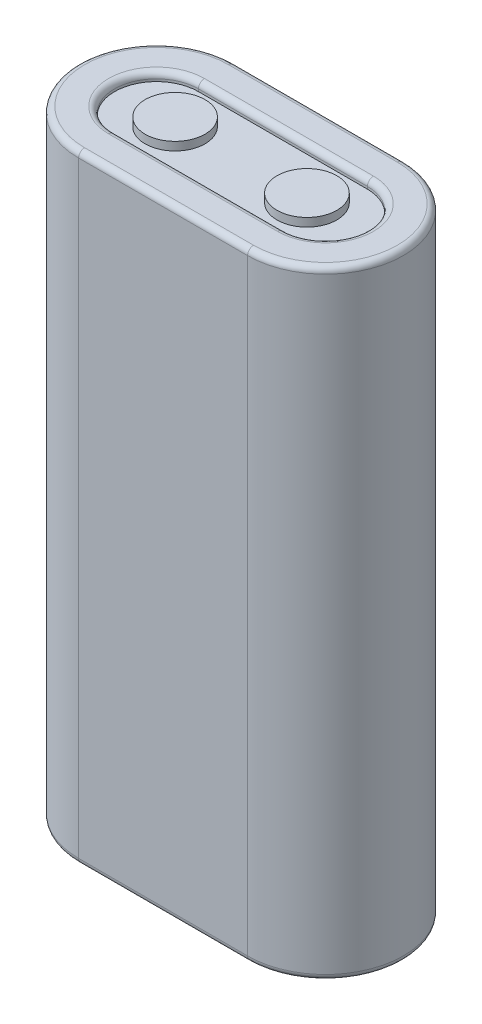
ISO-10303-21;
HEADER;
FILE_DESCRIPTION(('STEP AP214'),'2;1');
FILE_NAME('part.step','',(''),(''),'','','');
FILE_SCHEMA(('AUTOMOTIVE_DESIGN { 1 0 10303 214 1 1 1 1 }'));
ENDSEC;
DATA;
#1=APPLICATION_CONTEXT('core data for automotive mechanical design processes');
#2=APPLICATION_PROTOCOL_DEFINITION('international standard','automotive_design',2000,#1);
#3=PRODUCT_CONTEXT('',#1,'mechanical');
#4=PRODUCT('Part','Part','',(#3));
#5=PRODUCT_RELATED_PRODUCT_CATEGORY('part','',(#4));
#6=PRODUCT_DEFINITION_FORMATION('','',#4);
#7=PRODUCT_DEFINITION_CONTEXT('part definition',#1,'design');
#8=PRODUCT_DEFINITION('design','',#6,#7);
#9=PRODUCT_DEFINITION_SHAPE('','',#8);
#10=(LENGTH_UNIT() NAMED_UNIT(*) SI_UNIT(.MILLI.,.METRE.));
#11=(NAMED_UNIT(*) PLANE_ANGLE_UNIT() SI_UNIT($,.RADIAN.));
#12=(NAMED_UNIT(*) SI_UNIT($,.STERADIAN.) SOLID_ANGLE_UNIT());
#13=UNCERTAINTY_MEASURE_WITH_UNIT(LENGTH_MEASURE(1.E-05),#10,'distance_accuracy_value','');
#14=(GEOMETRIC_REPRESENTATION_CONTEXT(3) GLOBAL_UNCERTAINTY_ASSIGNED_CONTEXT((#13)) GLOBAL_UNIT_ASSIGNED_CONTEXT((#10,
#11,#12)) REPRESENTATION_CONTEXT('',''));
#15=CARTESIAN_POINT('',(0.,0.,0.));
#16=DIRECTION('',(0.,0.,1.));
#17=DIRECTION('',(1.,0.,0.));
#18=AXIS2_PLACEMENT_3D('',#15,#16,#17);
#19=CARTESIAN_POINT('',(7.05,51.6,0.));
#20=DIRECTION('',(0.,1.,0.));
#21=DIRECTION('',(0.,0.,1.));
#22=AXIS2_PLACEMENT_3D('',#19,#20,#21);
#23=PLANE('',#22);
#24=DIRECTION('',(1.,0.,0.));
#25=VECTOR('',#24,1.);
#26=CARTESIAN_POINT('',(7.05000000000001,51.6,6.));
#27=LINE('',#26,#25);
#28=CARTESIAN_POINT('',(-7.05000000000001,51.6,6.));
#29=VERTEX_POINT('',#28);
#30=CARTESIAN_POINT('',(7.05000000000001,51.6,6.));
#31=VERTEX_POINT('',#30);
#32=EDGE_CURVE('E230',#29,#31,#27,.T.);
#33=ORIENTED_EDGE('',*,*,#32,.T.);
#34=CARTESIAN_POINT('',(7.05,51.6,0.));
#35=DIRECTION('',(0.,1.,0.));
#36=DIRECTION('',(0.,0.,1.));
#37=AXIS2_PLACEMENT_3D('',#34,#35,#36);
#38=CIRCLE('',#37,6.);
#39=CARTESIAN_POINT('',(7.05000000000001,51.6,-6.));
#40=VERTEX_POINT('',#39);
#41=EDGE_CURVE('E232',#31,#40,#38,.T.);
#42=ORIENTED_EDGE('',*,*,#41,.T.);
#43=DIRECTION('',(-1.,0.,0.));
#44=VECTOR('',#43,1.);
#45=CARTESIAN_POINT('',(-7.05000000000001,51.6,-6.));
#46=LINE('',#45,#44);
#47=CARTESIAN_POINT('',(-7.05000000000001,51.6,-6.));
#48=VERTEX_POINT('',#47);
#49=EDGE_CURVE('E226',#40,#48,#46,.T.);
#50=ORIENTED_EDGE('',*,*,#49,.T.);
#51=CARTESIAN_POINT('',(-7.05,51.6,0.));
#52=DIRECTION('',(0.,1.,0.));
#53=DIRECTION('',(0.,0.,1.));
#54=AXIS2_PLACEMENT_3D('',#51,#52,#53);
#55=CIRCLE('',#54,6.);
#56=EDGE_CURVE('E228',#48,#29,#55,.T.);
#57=ORIENTED_EDGE('',*,*,#56,.T.);
#58=EDGE_LOOP('',(#33,#42,#50,#57));
#59=FACE_BOUND('',#58,.T.);
#60=CARTESIAN_POINT('',(7.05,51.6,0.));
#61=DIRECTION('',(0.,1.,0.));
#62=DIRECTION('',(0.,0.,1.));
#63=AXIS2_PLACEMENT_3D('',#60,#61,#62);
#64=CIRCLE('',#63,4.);
#65=CARTESIAN_POINT('',(7.05000000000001,51.6,-4.));
#66=VERTEX_POINT('',#65);
#67=CARTESIAN_POINT('',(7.05000000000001,51.6,4.));
#68=VERTEX_POINT('',#67);
#69=EDGE_CURVE('E221',#66,#68,#64,.F.);
#70=ORIENTED_EDGE('',*,*,#69,.T.);
#71=DIRECTION('',(-1.,0.,0.));
#72=VECTOR('',#71,1.);
#73=CARTESIAN_POINT('',(7.05,51.6,4.));
#74=LINE('',#73,#72);
#75=CARTESIAN_POINT('',(-7.05000000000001,51.6,4.));
#76=VERTEX_POINT('',#75);
#77=EDGE_CURVE('E223',#68,#76,#74,.T.);
#78=ORIENTED_EDGE('',*,*,#77,.T.);
#79=CARTESIAN_POINT('',(-7.05,51.6,0.));
#80=DIRECTION('',(0.,1.,0.));
#81=DIRECTION('',(0.,0.,1.));
#82=AXIS2_PLACEMENT_3D('',#79,#80,#81);
#83=CIRCLE('',#82,4.);
#84=CARTESIAN_POINT('',(-7.05000000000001,51.6,-4.));
#85=VERTEX_POINT('',#84);
#86=EDGE_CURVE('E217',#76,#85,#83,.F.);
#87=ORIENTED_EDGE('',*,*,#86,.T.);
#88=DIRECTION('',(1.,0.,0.));
#89=VECTOR('',#88,1.);
#90=CARTESIAN_POINT('',(7.05,51.6,-4.));
#91=LINE('',#90,#89);
#92=EDGE_CURVE('E219',#85,#66,#91,.T.);
#93=ORIENTED_EDGE('',*,*,#92,.T.);
#94=EDGE_LOOP('',(#70,#78,#87,#93));
#95=FACE_BOUND('',#94,.T.);
#96=ADVANCED_FACE('F31',(#59,#95),#23,.T.);
#97=CARTESIAN_POINT('',(7.05000000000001,51.6,6.5));
#98=DIRECTION('',(0.,0.,-1.));
#99=DIRECTION('',(-1.,0.,0.));
#100=AXIS2_PLACEMENT_3D('',#97,#98,#99);
#101=PLANE('',#100);
#102=DIRECTION('',(0.,-1.,0.));
#103=VECTOR('',#102,1.);
#104=CARTESIAN_POINT('',(-7.05000000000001,51.6,6.5));
#105=LINE('',#104,#103);
#106=CARTESIAN_POINT('',(-7.05000000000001,51.1,6.5));
#107=VERTEX_POINT('',#106);
#108=CARTESIAN_POINT('',(-7.05000000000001,0.500000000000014,6.5));
#109=VERTEX_POINT('',#108);
#110=EDGE_CURVE('E141',#107,#109,#105,.T.);
#111=ORIENTED_EDGE('',*,*,#110,.T.);
#112=DIRECTION('',(1.,0.,0.));
#113=VECTOR('',#112,1.);
#114=CARTESIAN_POINT('',(7.05000000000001,0.5,6.5));
#115=LINE('',#114,#113);
#116=CARTESIAN_POINT('',(7.05000000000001,0.500000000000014,6.5));
#117=VERTEX_POINT('',#116);
#118=EDGE_CURVE('E215',#109,#117,#115,.T.);
#119=ORIENTED_EDGE('',*,*,#118,.T.);
#120=DIRECTION('',(0.,-1.,0.));
#121=VECTOR('',#120,1.);
#122=CARTESIAN_POINT('',(7.05000000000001,51.6,6.5));
#123=LINE('',#122,#121);
#124=CARTESIAN_POINT('',(7.05000000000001,51.1,6.5));
#125=VERTEX_POINT('',#124);
#126=EDGE_CURVE('E187',#125,#117,#123,.T.);
#127=ORIENTED_EDGE('',*,*,#126,.F.);
#128=DIRECTION('',(1.,0.,0.));
#129=VECTOR('',#128,1.);
#130=CARTESIAN_POINT('',(-7.05000000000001,51.1,6.5));
#131=LINE('',#130,#129);
#132=EDGE_CURVE('E213',#125,#107,#131,.F.);
#133=ORIENTED_EDGE('',*,*,#132,.T.);
#134=EDGE_LOOP('',(#111,#119,#127,#133));
#135=FACE_BOUND('',#134,.T.);
#136=ADVANCED_FACE('F33',(#135),#101,.F.);
#137=CARTESIAN_POINT('',(7.05,51.6,0.));
#138=DIRECTION('',(0.,-1.,0.));
#139=DIRECTION('',(0.,0.,-1.));
#140=AXIS2_PLACEMENT_3D('',#137,#138,#139);
#141=CYLINDRICAL_SURFACE('',#140,6.5);
#142=ORIENTED_EDGE('',*,*,#126,.T.);
#143=CARTESIAN_POINT('',(7.05,0.5,0.));
#144=DIRECTION('',(0.,1.,0.));
#145=DIRECTION('',(0.,0.,1.));
#146=AXIS2_PLACEMENT_3D('',#143,#144,#145);
#147=CIRCLE('',#146,6.5);
#148=CARTESIAN_POINT('',(7.05000000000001,0.500000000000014,-6.5));
#149=VERTEX_POINT('',#148);
#150=EDGE_CURVE('E193',#117,#149,#147,.T.);
#151=ORIENTED_EDGE('',*,*,#150,.T.);
#152=DIRECTION('',(0.,-1.,0.));
#153=VECTOR('',#152,1.);
#154=CARTESIAN_POINT('',(7.05000000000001,51.6,-6.5));
#155=LINE('',#154,#153);
#156=CARTESIAN_POINT('',(7.05000000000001,51.1,-6.5));
#157=VERTEX_POINT('',#156);
#158=EDGE_CURVE('E184',#157,#149,#155,.T.);
#159=ORIENTED_EDGE('',*,*,#158,.F.);
#160=CARTESIAN_POINT('',(7.05,51.1,0.));
#161=DIRECTION('',(0.,1.,0.));
#162=DIRECTION('',(0.,0.,1.));
#163=AXIS2_PLACEMENT_3D('',#160,#161,#162);
#164=CIRCLE('',#163,6.5);
#165=EDGE_CURVE('E190',#157,#125,#164,.F.);
#166=ORIENTED_EDGE('',*,*,#165,.T.);
#167=EDGE_LOOP('',(#142,#151,#159,#166));
#168=FACE_BOUND('',#167,.T.);
#169=ADVANCED_FACE('F305',(#168),#141,.T.);
#170=CARTESIAN_POINT('',(7.05000000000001,51.6,-6.5));
#171=DIRECTION('',(0.,0.,1.));
#172=DIRECTION('',(1.,0.,0.));
#173=AXIS2_PLACEMENT_3D('',#170,#171,#172);
#174=PLANE('',#173);
#175=ORIENTED_EDGE('',*,*,#158,.T.);
#176=DIRECTION('',(-1.,0.,0.));
#177=VECTOR('',#176,1.);
#178=CARTESIAN_POINT('',(7.05000000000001,0.5,-6.5));
#179=LINE('',#178,#177);
#180=CARTESIAN_POINT('',(-7.05000000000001,0.500000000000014,-6.5));
#181=VERTEX_POINT('',#180);
#182=EDGE_CURVE('E207',#149,#181,#179,.T.);
#183=ORIENTED_EDGE('',*,*,#182,.T.);
#184=DIRECTION('',(0.,-1.,0.));
#185=VECTOR('',#184,1.);
#186=CARTESIAN_POINT('',(-7.05000000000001,51.6,-6.5));
#187=LINE('',#186,#185);
#188=CARTESIAN_POINT('',(-7.05000000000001,51.1,-6.5));
#189=VERTEX_POINT('',#188);
#190=EDGE_CURVE('E166',#189,#181,#187,.T.);
#191=ORIENTED_EDGE('',*,*,#190,.F.);
#192=DIRECTION('',(-1.,0.,0.));
#193=VECTOR('',#192,1.);
#194=CARTESIAN_POINT('',(7.05000000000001,51.1,-6.5));
#195=LINE('',#194,#193);
#196=EDGE_CURVE('E205',#189,#157,#195,.F.);
#197=ORIENTED_EDGE('',*,*,#196,.T.);
#198=EDGE_LOOP('',(#175,#183,#191,#197));
#199=FACE_BOUND('',#198,.T.);
#200=ADVANCED_FACE('F321',(#199),#174,.F.);
#201=CARTESIAN_POINT('',(7.05,0.,0.));
#202=DIRECTION('',(0.,1.,0.));
#203=DIRECTION('',(0.,0.,1.));
#204=AXIS2_PLACEMENT_3D('',#201,#202,#203);
#205=PLANE('',#204);
#206=DIRECTION('',(-1.,0.,0.));
#207=VECTOR('',#206,1.);
#208=CARTESIAN_POINT('',(7.05,0.,-6.));
#209=LINE('',#208,#207);
#210=CARTESIAN_POINT('',(-7.05000000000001,0.,-6.));
#211=VERTEX_POINT('',#210);
#212=CARTESIAN_POINT('',(7.05000000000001,0.,-6.));
#213=VERTEX_POINT('',#212);
#214=EDGE_CURVE('E200',#211,#213,#209,.F.);
#215=ORIENTED_EDGE('',*,*,#214,.T.);
#216=CARTESIAN_POINT('',(7.05,0.,0.));
#217=DIRECTION('',(0.,1.,0.));
#218=DIRECTION('',(0.,0.,1.));
#219=AXIS2_PLACEMENT_3D('',#216,#217,#218);
#220=CIRCLE('',#219,6.);
#221=CARTESIAN_POINT('',(7.05000000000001,0.,6.));
#222=VERTEX_POINT('',#221);
#223=EDGE_CURVE('E202',#213,#222,#220,.F.);
#224=ORIENTED_EDGE('',*,*,#223,.T.);
#225=DIRECTION('',(1.,0.,0.));
#226=VECTOR('',#225,1.);
#227=CARTESIAN_POINT('',(7.05,0.,6.));
#228=LINE('',#227,#226);
#229=CARTESIAN_POINT('',(-7.05000000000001,0.,6.));
#230=VERTEX_POINT('',#229);
#231=EDGE_CURVE('E196',#222,#230,#228,.F.);
#232=ORIENTED_EDGE('',*,*,#231,.T.);
#233=CARTESIAN_POINT('',(-7.05,0.,0.));
#234=DIRECTION('',(0.,1.,0.));
#235=DIRECTION('',(0.,0.,1.));
#236=AXIS2_PLACEMENT_3D('',#233,#234,#235);
#237=CIRCLE('',#236,6.);
#238=EDGE_CURVE('E198',#230,#211,#237,.F.);
#239=ORIENTED_EDGE('',*,*,#238,.T.);
#240=EDGE_LOOP('',(#215,#224,#232,#239));
#241=FACE_BOUND('',#240,.T.);
#242=ADVANCED_FACE('F323',(#241),#205,.F.);
#243=CARTESIAN_POINT('',(2.99917302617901,50.9,0.));
#244=DIRECTION('',(0.,1.,0.));
#245=DIRECTION('',(0.,0.,1.));
#246=AXIS2_PLACEMENT_3D('',#243,#244,#245);
#247=PLANE('',#246);
#248=CARTESIAN_POINT('',(5.5,50.9,0.));
#249=DIRECTION('',(0.,1.,0.));
#250=DIRECTION('',(0.,0.,1.));
#251=AXIS2_PLACEMENT_3D('',#248,#249,#250);
#252=CIRCLE('',#251,2.5);
#253=CARTESIAN_POINT('',(5.5,50.9,2.5));
#254=VERTEX_POINT('',#253);
#255=EDGE_CURVE('E181',#254,#254,#252,.T.);
#256=ORIENTED_EDGE('',*,*,#255,.F.);
#257=EDGE_LOOP('',(#256));
#258=FACE_BOUND('',#257,.T.);
#259=DIRECTION('',(1.,0.,0.));
#260=VECTOR('',#259,1.);
#261=CARTESIAN_POINT('',(0.,50.9,-3.5));
#262=LINE('',#261,#260);
#263=CARTESIAN_POINT('',(-7.05000000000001,50.9,-3.5));
#264=VERTEX_POINT('',#263);
#265=CARTESIAN_POINT('',(7.05000000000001,50.9,-3.5));
#266=VERTEX_POINT('',#265);
#267=EDGE_CURVE('E133',#264,#266,#262,.T.);
#268=ORIENTED_EDGE('',*,*,#267,.F.);
#269=CARTESIAN_POINT('',(-7.05,50.9,0.));
#270=DIRECTION('',(0.,1.,0.));
#271=DIRECTION('',(0.,0.,1.));
#272=AXIS2_PLACEMENT_3D('',#269,#270,#271);
#273=CIRCLE('',#272,3.5);
#274=CARTESIAN_POINT('',(-7.05000000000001,50.9,3.5));
#275=VERTEX_POINT('',#274);
#276=EDGE_CURVE('E138',#264,#275,#273,.T.);
#277=ORIENTED_EDGE('',*,*,#276,.T.);
#278=DIRECTION('',(-1.,0.,0.));
#279=VECTOR('',#278,1.);
#280=CARTESIAN_POINT('',(0.,50.9,3.5));
#281=LINE('',#280,#279);
#282=CARTESIAN_POINT('',(7.05000000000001,50.9,3.5));
#283=VERTEX_POINT('',#282);
#284=EDGE_CURVE('E172',#283,#275,#281,.T.);
#285=ORIENTED_EDGE('',*,*,#284,.F.);
#286=CARTESIAN_POINT('',(7.05,50.9,0.));
#287=DIRECTION('',(0.,-1.,0.));
#288=DIRECTION('',(0.,0.,1.));
#289=AXIS2_PLACEMENT_3D('',#286,#287,#288);
#290=CIRCLE('',#289,3.5);
#291=EDGE_CURVE('E140',#266,#283,#290,.T.);
#292=ORIENTED_EDGE('',*,*,#291,.F.);
#293=EDGE_LOOP('',(#268,#277,#285,#292));
#294=FACE_BOUND('',#293,.T.);
#295=CARTESIAN_POINT('',(-5.5,50.9,0.));
#296=DIRECTION('',(0.,-1.,0.));
#297=DIRECTION('',(0.,0.,1.));
#298=AXIS2_PLACEMENT_3D('',#295,#296,#297);
#299=CIRCLE('',#298,2.5);
#300=CARTESIAN_POINT('',(-5.5,50.9,2.5));
#301=VERTEX_POINT('',#300);
#302=EDGE_CURVE('E163',#301,#301,#299,.T.);
#303=ORIENTED_EDGE('',*,*,#302,.T.);
#304=EDGE_LOOP('',(#303));
#305=FACE_BOUND('',#304,.T.);
#306=ADVANCED_FACE('F134',(#258,#294,#305),#247,.T.);
#307=CARTESIAN_POINT('',(5.5,50.9,0.));
#308=DIRECTION('',(0.,1.,0.));
#309=DIRECTION('',(0.,0.,1.));
#310=AXIS2_PLACEMENT_3D('',#307,#308,#309);
#311=CYLINDRICAL_SURFACE('',#310,2.5);
#312=ORIENTED_EDGE('',*,*,#255,.T.);
#313=EDGE_LOOP('',(#312));
#314=FACE_BOUND('',#313,.T.);
#315=CARTESIAN_POINT('',(5.5,51.6,0.));
#316=DIRECTION('',(0.,1.,0.));
#317=DIRECTION('',(0.,0.,1.));
#318=AXIS2_PLACEMENT_3D('',#315,#316,#317);
#319=CIRCLE('',#318,2.5);
#320=CARTESIAN_POINT('',(5.5,51.6,2.5));
#321=VERTEX_POINT('',#320);
#322=EDGE_CURVE('E177',#321,#321,#319,.T.);
#323=ORIENTED_EDGE('',*,*,#322,.F.);
#324=EDGE_LOOP('',(#323));
#325=FACE_BOUND('',#324,.T.);
#326=ADVANCED_FACE('F348',(#314,#325),#311,.T.);
#327=CARTESIAN_POINT('',(0.,50.9,3.5));
#328=DIRECTION('',(0.,0.,-1.));
#329=DIRECTION('',(-1.,0.,0.));
#330=AXIS2_PLACEMENT_3D('',#327,#328,#329);
#331=PLANE('',#330);
#332=DIRECTION('',(0.,1.,0.));
#333=VECTOR('',#332,1.);
#334=CARTESIAN_POINT('',(-7.05000000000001,50.9,3.5));
#335=LINE('',#334,#333);
#336=CARTESIAN_POINT('',(-7.05000000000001,51.1,3.5));
#337=VERTEX_POINT('',#336);
#338=EDGE_CURVE('E147',#275,#337,#335,.T.);
#339=ORIENTED_EDGE('',*,*,#338,.T.);
#340=DIRECTION('',(-1.,0.,0.));
#341=VECTOR('',#340,1.);
#342=CARTESIAN_POINT('',(0.,51.1,3.5));
#343=LINE('',#342,#341);
#344=CARTESIAN_POINT('',(7.05000000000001,51.1,3.5));
#345=VERTEX_POINT('',#344);
#346=EDGE_CURVE('E235',#337,#345,#343,.F.);
#347=ORIENTED_EDGE('',*,*,#346,.T.);
#348=DIRECTION('',(0.,1.,0.));
#349=VECTOR('',#348,1.);
#350=CARTESIAN_POINT('',(7.05000000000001,50.9,3.5));
#351=LINE('',#350,#349);
#352=EDGE_CURVE('E175',#283,#345,#351,.T.);
#353=ORIENTED_EDGE('',*,*,#352,.F.);
#354=ORIENTED_EDGE('',*,*,#284,.T.);
#355=EDGE_LOOP('',(#339,#347,#353,#354));
#356=FACE_BOUND('',#355,.T.);
#357=ADVANCED_FACE('F240',(#356),#331,.T.);
#358=CARTESIAN_POINT('',(7.05,50.9,0.));
#359=DIRECTION('',(0.,1.,0.));
#360=DIRECTION('',(0.,0.,1.));
#361=AXIS2_PLACEMENT_3D('',#358,#359,#360);
#362=CYLINDRICAL_SURFACE('',#361,3.5);
#363=ORIENTED_EDGE('',*,*,#352,.T.);
#364=CARTESIAN_POINT('',(7.05,51.1,0.));
#365=DIRECTION('',(0.,1.,0.));
#366=DIRECTION('',(0.,0.,1.));
#367=AXIS2_PLACEMENT_3D('',#364,#365,#366);
#368=CIRCLE('',#367,3.5);
#369=CARTESIAN_POINT('',(7.05000000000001,51.1,-3.5));
#370=VERTEX_POINT('',#369);
#371=EDGE_CURVE('E53',#345,#370,#368,.T.);
#372=ORIENTED_EDGE('',*,*,#371,.T.);
#373=DIRECTION('',(0.,1.,0.));
#374=VECTOR('',#373,1.);
#375=CARTESIAN_POINT('',(7.05000000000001,50.9,-3.5));
#376=LINE('',#375,#374);
#377=EDGE_CURVE('E174',#266,#370,#376,.T.);
#378=ORIENTED_EDGE('',*,*,#377,.F.);
#379=ORIENTED_EDGE('',*,*,#291,.T.);
#380=EDGE_LOOP('',(#363,#372,#378,#379));
#381=FACE_BOUND('',#380,.T.);
#382=ADVANCED_FACE('F243',(#381),#362,.F.);
#383=CARTESIAN_POINT('',(0.,50.9,-3.5));
#384=DIRECTION('',(0.,0.,1.));
#385=DIRECTION('',(1.,0.,0.));
#386=AXIS2_PLACEMENT_3D('',#383,#384,#385);
#387=PLANE('',#386);
#388=ORIENTED_EDGE('',*,*,#377,.T.);
#389=DIRECTION('',(1.,0.,0.));
#390=VECTOR('',#389,1.);
#391=CARTESIAN_POINT('',(0.,51.1,-3.5));
#392=LINE('',#391,#390);
#393=CARTESIAN_POINT('',(-7.05000000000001,51.1,-3.5));
#394=VERTEX_POINT('',#393);
#395=EDGE_CURVE('E39',#370,#394,#392,.F.);
#396=ORIENTED_EDGE('',*,*,#395,.T.);
#397=DIRECTION('',(0.,1.,0.));
#398=VECTOR('',#397,1.);
#399=CARTESIAN_POINT('',(-7.05000000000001,50.9,-3.5));
#400=LINE('',#399,#398);
#401=EDGE_CURVE('E143',#264,#394,#400,.T.);
#402=ORIENTED_EDGE('',*,*,#401,.F.);
#403=ORIENTED_EDGE('',*,*,#267,.T.);
#404=EDGE_LOOP('',(#388,#396,#402,#403));
#405=FACE_BOUND('',#404,.T.);
#406=ADVANCED_FACE('F144',(#405),#387,.T.);
#407=ORIENTED_EDGE('',*,*,#322,.T.);
#408=EDGE_LOOP('',(#407));
#409=FACE_BOUND('',#408,.T.);
#410=ADVANCED_FACE('F333',(#409),#23,.T.);
#411=CARTESIAN_POINT('',(-7.05,51.6,0.));
#412=DIRECTION('',(0.,-1.,0.));
#413=DIRECTION('',(0.,0.,-1.));
#414=AXIS2_PLACEMENT_3D('',#411,#412,#413);
#415=CYLINDRICAL_SURFACE('',#414,6.5);
#416=ORIENTED_EDGE('',*,*,#190,.T.);
#417=CARTESIAN_POINT('',(-7.05,0.5,0.));
#418=DIRECTION('',(0.,1.,0.));
#419=DIRECTION('',(0.,0.,1.));
#420=AXIS2_PLACEMENT_3D('',#417,#418,#419);
#421=CIRCLE('',#420,6.5);
#422=EDGE_CURVE('E211',#181,#109,#421,.T.);
#423=ORIENTED_EDGE('',*,*,#422,.T.);
#424=ORIENTED_EDGE('',*,*,#110,.F.);
#425=CARTESIAN_POINT('',(-7.05,51.1,0.));
#426=DIRECTION('',(0.,1.,0.));
#427=DIRECTION('',(0.,0.,1.));
#428=AXIS2_PLACEMENT_3D('',#425,#426,#427);
#429=CIRCLE('',#428,6.5);
#430=EDGE_CURVE('E209',#107,#189,#429,.F.);
#431=ORIENTED_EDGE('',*,*,#430,.T.);
#432=EDGE_LOOP('',(#416,#423,#424,#431));
#433=FACE_BOUND('',#432,.T.);
#434=ADVANCED_FACE('F290',(#433),#415,.T.);
#435=CARTESIAN_POINT('',(-5.5,50.9,0.));
#436=DIRECTION('',(0.,1.,0.));
#437=DIRECTION('',(0.,0.,1.));
#438=AXIS2_PLACEMENT_3D('',#435,#436,#437);
#439=CYLINDRICAL_SURFACE('',#438,2.5);
#440=ORIENTED_EDGE('',*,*,#302,.F.);
#441=EDGE_LOOP('',(#440));
#442=FACE_BOUND('',#441,.T.);
#443=CARTESIAN_POINT('',(-5.5,51.6,0.));
#444=DIRECTION('',(0.,-1.,0.));
#445=DIRECTION('',(0.,0.,1.));
#446=AXIS2_PLACEMENT_3D('',#443,#444,#445);
#447=CIRCLE('',#446,2.5);
#448=CARTESIAN_POINT('',(-5.5,51.6,2.5));
#449=VERTEX_POINT('',#448);
#450=EDGE_CURVE('E159',#449,#449,#447,.T.);
#451=ORIENTED_EDGE('',*,*,#450,.T.);
#452=EDGE_LOOP('',(#451));
#453=FACE_BOUND('',#452,.T.);
#454=ADVANCED_FACE('F343',(#442,#453),#439,.T.);
#455=CARTESIAN_POINT('',(-7.05,50.9,0.));
#456=DIRECTION('',(0.,1.,0.));
#457=DIRECTION('',(0.,0.,1.));
#458=AXIS2_PLACEMENT_3D('',#455,#456,#457);
#459=CYLINDRICAL_SURFACE('',#458,3.5);
#460=ORIENTED_EDGE('',*,*,#401,.T.);
#461=CARTESIAN_POINT('',(-7.05,51.1,0.));
#462=DIRECTION('',(0.,1.,0.));
#463=DIRECTION('',(0.,0.,1.));
#464=AXIS2_PLACEMENT_3D('',#461,#462,#463);
#465=CIRCLE('',#464,3.5);
#466=EDGE_CURVE('E12',#394,#337,#465,.T.);
#467=ORIENTED_EDGE('',*,*,#466,.T.);
#468=ORIENTED_EDGE('',*,*,#338,.F.);
#469=ORIENTED_EDGE('',*,*,#276,.F.);
#470=EDGE_LOOP('',(#460,#467,#468,#469));
#471=FACE_BOUND('',#470,.T.);
#472=ADVANCED_FACE('F150',(#471),#459,.F.);
#473=CARTESIAN_POINT('',(-7.05,51.6,0.));
#474=DIRECTION('',(0.,1.,0.));
#475=DIRECTION('',(0.,0.,1.));
#476=AXIS2_PLACEMENT_3D('',#473,#474,#475);
#477=PLANE('',#476);
#478=ORIENTED_EDGE('',*,*,#450,.F.);
#479=EDGE_LOOP('',(#478));
#480=FACE_BOUND('',#479,.T.);
#481=ADVANCED_FACE('F362',(#480),#477,.T.);
#482=CARTESIAN_POINT('',(-7.05,0.5,0.));
#483=DIRECTION('',(0.,1.,0.));
#484=DIRECTION('',(0.,0.,1.));
#485=AXIS2_PLACEMENT_3D('',#482,#483,#484);
#486=TOROIDAL_SURFACE('',#485,6.,0.5);
#487=CARTESIAN_POINT('',(-7.05000000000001,0.5,-6.));
#488=DIRECTION('',(1.,0.,0.));
#489=DIRECTION('',(0.,0.,-1.));
#490=AXIS2_PLACEMENT_3D('',#487,#488,#489);
#491=CIRCLE('',#490,0.5);
#492=EDGE_CURVE('E155',#211,#181,#491,.T.);
#493=ORIENTED_EDGE('',*,*,#492,.F.);
#494=ORIENTED_EDGE('',*,*,#238,.F.);
#495=CARTESIAN_POINT('',(-7.05000000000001,0.5,6.));
#496=DIRECTION('',(1.,0.,0.));
#497=DIRECTION('',(0.,0.,-1.));
#498=AXIS2_PLACEMENT_3D('',#495,#496,#497);
#499=CIRCLE('',#498,0.5);
#500=EDGE_CURVE('E152',#109,#230,#499,.T.);
#501=ORIENTED_EDGE('',*,*,#500,.F.);
#502=ORIENTED_EDGE('',*,*,#422,.F.);
#503=EDGE_LOOP('',(#493,#494,#501,#502));
#504=FACE_BOUND('',#503,.T.);
#505=ADVANCED_FACE('F285',(#504),#486,.T.);
#506=CARTESIAN_POINT('',(7.05000000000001,0.5,6.));
#507=DIRECTION('',(1.,0.,0.));
#508=DIRECTION('',(0.,0.,-1.));
#509=AXIS2_PLACEMENT_3D('',#506,#507,#508);
#510=CYLINDRICAL_SURFACE('',#509,0.5);
#511=ORIENTED_EDGE('',*,*,#500,.T.);
#512=ORIENTED_EDGE('',*,*,#231,.F.);
#513=CARTESIAN_POINT('',(7.05000000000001,0.5,6.));
#514=DIRECTION('',(1.,0.,0.));
#515=DIRECTION('',(0.,1.,0.));
#516=AXIS2_PLACEMENT_3D('',#513,#514,#515);
#517=CIRCLE('',#516,0.5);
#518=EDGE_CURVE('E274',#117,#222,#517,.T.);
#519=ORIENTED_EDGE('',*,*,#518,.F.);
#520=ORIENTED_EDGE('',*,*,#118,.F.);
#521=EDGE_LOOP('',(#511,#512,#519,#520));
#522=FACE_BOUND('',#521,.T.);
#523=ADVANCED_FACE('F373',(#522),#510,.T.);
#524=CARTESIAN_POINT('',(7.05000000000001,0.5,-6.));
#525=DIRECTION('',(-1.,0.,0.));
#526=DIRECTION('',(0.,0.,1.));
#527=AXIS2_PLACEMENT_3D('',#524,#525,#526);
#528=CYLINDRICAL_SURFACE('',#527,0.5);
#529=ORIENTED_EDGE('',*,*,#492,.T.);
#530=ORIENTED_EDGE('',*,*,#182,.F.);
#531=CARTESIAN_POINT('',(7.05000000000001,0.5,-6.));
#532=DIRECTION('',(1.,0.,0.));
#533=DIRECTION('',(0.,0.,-1.));
#534=AXIS2_PLACEMENT_3D('',#531,#532,#533);
#535=CIRCLE('',#534,0.5);
#536=EDGE_CURVE('E272',#213,#149,#535,.T.);
#537=ORIENTED_EDGE('',*,*,#536,.F.);
#538=ORIENTED_EDGE('',*,*,#214,.F.);
#539=EDGE_LOOP('',(#529,#530,#537,#538));
#540=FACE_BOUND('',#539,.T.);
#541=ADVANCED_FACE('F280',(#540),#528,.T.);
#542=CARTESIAN_POINT('',(7.05,0.5,0.));
#543=DIRECTION('',(0.,1.,0.));
#544=DIRECTION('',(0.,0.,1.));
#545=AXIS2_PLACEMENT_3D('',#542,#543,#544);
#546=TOROIDAL_SURFACE('',#545,6.,0.5);
#547=ORIENTED_EDGE('',*,*,#518,.T.);
#548=ORIENTED_EDGE('',*,*,#223,.F.);
#549=ORIENTED_EDGE('',*,*,#536,.T.);
#550=ORIENTED_EDGE('',*,*,#150,.F.);
#551=EDGE_LOOP('',(#547,#548,#549,#550));
#552=FACE_BOUND('',#551,.T.);
#553=ADVANCED_FACE('F379',(#552),#546,.T.);
#554=CARTESIAN_POINT('',(-7.05,51.1,0.));
#555=DIRECTION('',(0.,1.,0.));
#556=DIRECTION('',(0.,0.,1.));
#557=AXIS2_PLACEMENT_3D('',#554,#555,#556);
#558=TOROIDAL_SURFACE('',#557,6.,0.5);
#559=CARTESIAN_POINT('',(-7.05000000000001,51.1,-6.));
#560=DIRECTION('',(1.,0.,0.));
#561=DIRECTION('',(0.,0.,-1.));
#562=AXIS2_PLACEMENT_3D('',#559,#560,#561);
#563=CIRCLE('',#562,0.5);
#564=EDGE_CURVE('E266',#189,#48,#563,.T.);
#565=ORIENTED_EDGE('',*,*,#564,.F.);
#566=ORIENTED_EDGE('',*,*,#430,.F.);
#567=CARTESIAN_POINT('',(-7.05000000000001,51.1,6.));
#568=DIRECTION('',(1.,0.,0.));
#569=DIRECTION('',(0.,0.,-1.));
#570=AXIS2_PLACEMENT_3D('',#567,#568,#569);
#571=CIRCLE('',#570,0.5);
#572=EDGE_CURVE('E269',#29,#107,#571,.T.);
#573=ORIENTED_EDGE('',*,*,#572,.F.);
#574=ORIENTED_EDGE('',*,*,#56,.F.);
#575=EDGE_LOOP('',(#565,#566,#573,#574));
#576=FACE_BOUND('',#575,.T.);
#577=ADVANCED_FACE('F319',(#576),#558,.T.);
#578=CARTESIAN_POINT('',(7.05,51.1,6.));
#579=DIRECTION('',(-1.,0.,0.));
#580=DIRECTION('',(0.,0.,1.));
#581=AXIS2_PLACEMENT_3D('',#578,#579,#580);
#582=CYLINDRICAL_SURFACE('',#581,0.5);
#583=ORIENTED_EDGE('',*,*,#572,.T.);
#584=ORIENTED_EDGE('',*,*,#132,.F.);
#585=CARTESIAN_POINT('',(7.05000000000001,51.1,6.));
#586=DIRECTION('',(1.,0.,0.));
#587=DIRECTION('',(0.,0.,-1.));
#588=AXIS2_PLACEMENT_3D('',#585,#586,#587);
#589=CIRCLE('',#588,0.5);
#590=EDGE_CURVE('E259',#31,#125,#589,.T.);
#591=ORIENTED_EDGE('',*,*,#590,.F.);
#592=ORIENTED_EDGE('',*,*,#32,.F.);
#593=EDGE_LOOP('',(#583,#584,#591,#592));
#594=FACE_BOUND('',#593,.T.);
#595=ADVANCED_FACE('F298',(#594),#582,.T.);
#596=CARTESIAN_POINT('',(7.05,51.1,-6.));
#597=DIRECTION('',(1.,0.,0.));
#598=DIRECTION('',(0.,0.,-1.));
#599=AXIS2_PLACEMENT_3D('',#596,#597,#598);
#600=CYLINDRICAL_SURFACE('',#599,0.5);
#601=ORIENTED_EDGE('',*,*,#564,.T.);
#602=ORIENTED_EDGE('',*,*,#49,.F.);
#603=CARTESIAN_POINT('',(7.05000000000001,51.1,-6.));
#604=DIRECTION('',(1.,0.,0.));
#605=DIRECTION('',(0.,1.,0.));
#606=AXIS2_PLACEMENT_3D('',#603,#604,#605);
#607=CIRCLE('',#606,0.5);
#608=EDGE_CURVE('E257',#157,#40,#607,.T.);
#609=ORIENTED_EDGE('',*,*,#608,.F.);
#610=ORIENTED_EDGE('',*,*,#196,.F.);
#611=EDGE_LOOP('',(#601,#602,#609,#610));
#612=FACE_BOUND('',#611,.T.);
#613=ADVANCED_FACE('F313',(#612),#600,.T.);
#614=CARTESIAN_POINT('',(7.05,51.1,0.));
#615=DIRECTION('',(0.,1.,0.));
#616=DIRECTION('',(0.,0.,1.));
#617=AXIS2_PLACEMENT_3D('',#614,#615,#616);
#618=TOROIDAL_SURFACE('',#617,6.,0.5);
#619=ORIENTED_EDGE('',*,*,#590,.T.);
#620=ORIENTED_EDGE('',*,*,#165,.F.);
#621=ORIENTED_EDGE('',*,*,#608,.T.);
#622=ORIENTED_EDGE('',*,*,#41,.F.);
#623=EDGE_LOOP('',(#619,#620,#621,#622));
#624=FACE_BOUND('',#623,.T.);
#625=ADVANCED_FACE('F309',(#624),#618,.T.);
#626=CARTESIAN_POINT('',(7.05,51.1,-4.));
#627=DIRECTION('',(1.,0.,0.));
#628=DIRECTION('',(0.,0.,-1.));
#629=AXIS2_PLACEMENT_3D('',#626,#627,#628);
#630=CYLINDRICAL_SURFACE('',#629,0.5);
#631=CARTESIAN_POINT('',(-7.05000000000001,51.1,-4.));
#632=DIRECTION('',(-1.,0.,0.));
#633=DIRECTION('',(0.,0.,1.));
#634=AXIS2_PLACEMENT_3D('',#631,#632,#633);
#635=CIRCLE('',#634,0.5);
#636=EDGE_CURVE('E252',#394,#85,#635,.T.);
#637=ORIENTED_EDGE('',*,*,#636,.F.);
#638=ORIENTED_EDGE('',*,*,#395,.F.);
#639=CARTESIAN_POINT('',(7.05000000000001,51.1,-4.));
#640=DIRECTION('',(1.,0.,0.));
#641=DIRECTION('',(0.,0.,-1.));
#642=AXIS2_PLACEMENT_3D('',#639,#640,#641);
#643=CIRCLE('',#642,0.5);
#644=EDGE_CURVE('E249',#66,#370,#643,.T.);
#645=ORIENTED_EDGE('',*,*,#644,.F.);
#646=ORIENTED_EDGE('',*,*,#92,.F.);
#647=EDGE_LOOP('',(#637,#638,#645,#646));
#648=FACE_BOUND('',#647,.T.);
#649=ADVANCED_FACE('F247',(#648),#630,.T.);
#650=CARTESIAN_POINT('',(7.05,51.1,0.));
#651=DIRECTION('',(0.,1.,0.));
#652=DIRECTION('',(0.,0.,1.));
#653=AXIS2_PLACEMENT_3D('',#650,#651,#652);
#654=TOROIDAL_SURFACE('',#653,4.,0.5);
#655=ORIENTED_EDGE('',*,*,#644,.T.);
#656=ORIENTED_EDGE('',*,*,#371,.F.);
#657=CARTESIAN_POINT('',(7.05000000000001,51.1,4.));
#658=DIRECTION('',(-1.,0.,0.));
#659=DIRECTION('',(0.,0.,1.));
#660=AXIS2_PLACEMENT_3D('',#657,#658,#659);
#661=CIRCLE('',#660,0.5);
#662=EDGE_CURVE('E261',#68,#345,#661,.T.);
#663=ORIENTED_EDGE('',*,*,#662,.F.);
#664=ORIENTED_EDGE('',*,*,#69,.F.);
#665=EDGE_LOOP('',(#655,#656,#663,#664));
#666=FACE_BOUND('',#665,.T.);
#667=ADVANCED_FACE('F255',(#666),#654,.T.);
#668=CARTESIAN_POINT('',(-7.05,51.1,0.));
#669=DIRECTION('',(0.,1.,0.));
#670=DIRECTION('',(0.,0.,1.));
#671=AXIS2_PLACEMENT_3D('',#668,#669,#670);
#672=TOROIDAL_SURFACE('',#671,4.,0.5);
#673=ORIENTED_EDGE('',*,*,#636,.T.);
#674=ORIENTED_EDGE('',*,*,#86,.F.);
#675=CARTESIAN_POINT('',(-7.05000000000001,51.1,4.));
#676=DIRECTION('',(1.,0.,0.));
#677=DIRECTION('',(0.,0.,-1.));
#678=AXIS2_PLACEMENT_3D('',#675,#676,#677);
#679=CIRCLE('',#678,0.5);
#680=EDGE_CURVE('E404',#337,#76,#679,.T.);
#681=ORIENTED_EDGE('',*,*,#680,.F.);
#682=ORIENTED_EDGE('',*,*,#466,.F.);
#683=EDGE_LOOP('',(#673,#674,#681,#682));
#684=FACE_BOUND('',#683,.T.);
#685=ADVANCED_FACE('F395',(#684),#672,.T.);
#686=CARTESIAN_POINT('',(7.05,51.1,4.));
#687=DIRECTION('',(-1.,0.,0.));
#688=DIRECTION('',(0.,0.,1.));
#689=AXIS2_PLACEMENT_3D('',#686,#687,#688);
#690=CYLINDRICAL_SURFACE('',#689,0.5);
#691=ORIENTED_EDGE('',*,*,#662,.T.);
#692=ORIENTED_EDGE('',*,*,#346,.F.);
#693=ORIENTED_EDGE('',*,*,#680,.T.);
#694=ORIENTED_EDGE('',*,*,#77,.F.);
#695=EDGE_LOOP('',(#691,#692,#693,#694));
#696=FACE_BOUND('',#695,.T.);
#697=ADVANCED_FACE('F398',(#696),#690,.T.);
#698=CLOSED_SHELL('',(#96,#136,#169,#200,#242,#306,#326,#357,#382,#406,#410,#434,#454,#472,#481,
#505,#523,#541,#553,#577,#595,#613,#625,#649,#667,#685,#697));
#699=MANIFOLD_SOLID_BREP('B2',#698);
#700=ADVANCED_BREP_SHAPE_REPRESENTATION('',(#18,#699),#14);
#701=SHAPE_DEFINITION_REPRESENTATION(#9,#700);
ENDSEC;
END-ISO-10303-21;
